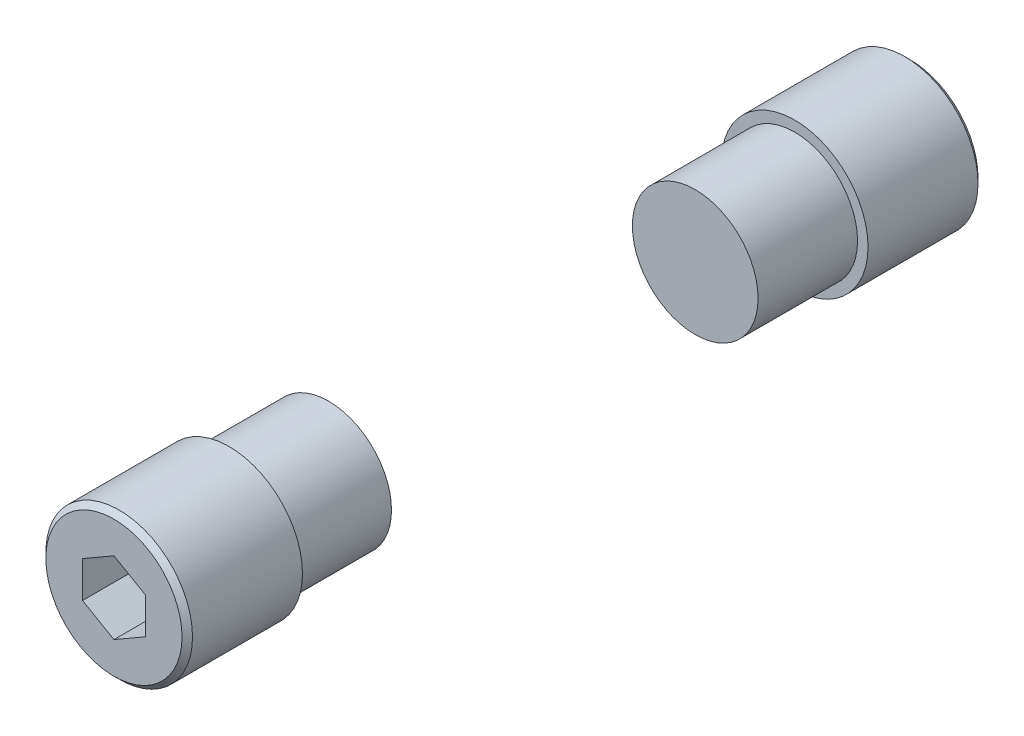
ISO-10303-21;
HEADER;
FILE_DESCRIPTION(('STEP AP214'),'2;1');
FILE_NAME('part.step','',(''),(''),'','','');
FILE_SCHEMA(('AUTOMOTIVE_DESIGN { 1 0 10303 214 1 1 1 1 }'));
ENDSEC;
DATA;
#1=APPLICATION_CONTEXT('core data for automotive mechanical design processes');
#2=APPLICATION_PROTOCOL_DEFINITION('international standard','automotive_design',2000,#1);
#3=PRODUCT_CONTEXT('',#1,'mechanical');
#4=PRODUCT('Part','Part','',(#3));
#5=PRODUCT_RELATED_PRODUCT_CATEGORY('part','',(#4));
#6=PRODUCT_DEFINITION_FORMATION('','',#4);
#7=PRODUCT_DEFINITION_CONTEXT('part definition',#1,'design');
#8=PRODUCT_DEFINITION('design','',#6,#7);
#9=PRODUCT_DEFINITION_SHAPE('','',#8);
#10=(LENGTH_UNIT() NAMED_UNIT(*) SI_UNIT(.MILLI.,.METRE.));
#11=(NAMED_UNIT(*) PLANE_ANGLE_UNIT() SI_UNIT($,.RADIAN.));
#12=(NAMED_UNIT(*) SI_UNIT($,.STERADIAN.) SOLID_ANGLE_UNIT());
#13=UNCERTAINTY_MEASURE_WITH_UNIT(LENGTH_MEASURE(1.E-05),#10,'distance_accuracy_value','');
#14=(GEOMETRIC_REPRESENTATION_CONTEXT(3) GLOBAL_UNCERTAINTY_ASSIGNED_CONTEXT((#13)) GLOBAL_UNIT_ASSIGNED_CONTEXT((#10,
#11,#12)) REPRESENTATION_CONTEXT('',''));
#15=CARTESIAN_POINT('',(0.,0.,0.));
#16=DIRECTION('',(0.,0.,1.));
#17=DIRECTION('',(1.,0.,0.));
#18=AXIS2_PLACEMENT_3D('',#15,#16,#17);
#19=CARTESIAN_POINT('',(0.,0.,27.));
#20=DIRECTION('',(0.,0.,1.));
#21=DIRECTION('',(1.,0.,0.));
#22=AXIS2_PLACEMENT_3D('',#19,#20,#21);
#23=PLANE('',#22);
#24=CARTESIAN_POINT('',(0.,0.,27.));
#25=DIRECTION('',(0.,0.,1.));
#26=DIRECTION('',(1.,0.,0.));
#27=AXIS2_PLACEMENT_3D('',#24,#25,#26);
#28=CIRCLE('',#27,7.);
#29=CARTESIAN_POINT('',(7.,0.,27.));
#30=VERTEX_POINT('',#29);
#31=EDGE_CURVE('P0_E120',#30,#30,#28,.T.);
#32=ORIENTED_EDGE('',*,*,#31,.F.);
#33=EDGE_LOOP('',(#32));
#34=FACE_BOUND('',#33,.T.);
#35=CARTESIAN_POINT('',(0.,0.,27.));
#36=DIRECTION('',(0.,0.,1.));
#37=DIRECTION('',(1.,0.,0.));
#38=AXIS2_PLACEMENT_3D('',#35,#36,#37);
#39=CIRCLE('',#38,6.);
#40=CARTESIAN_POINT('',(6.,0.,27.));
#41=VERTEX_POINT('',#40);
#42=EDGE_CURVE('P0_E11',#41,#41,#39,.F.);
#43=ORIENTED_EDGE('',*,*,#42,.F.);
#44=EDGE_LOOP('',(#43));
#45=FACE_BOUND('',#44,.T.);
#46=ADVANCED_FACE('P0_F17',(#34,#45),#23,.F.);
#47=CARTESIAN_POINT('',(0.,0.,27.));
#48=DIRECTION('',(0.,0.,1.));
#49=DIRECTION('',(1.,0.,0.));
#50=AXIS2_PLACEMENT_3D('',#47,#48,#49);
#51=CYLINDRICAL_SURFACE('',#50,7.);
#52=CARTESIAN_POINT('',(0.,0.,37.5));
#53=DIRECTION('',(0.,0.,1.));
#54=DIRECTION('',(1.,0.,0.));
#55=AXIS2_PLACEMENT_3D('',#52,#53,#54);
#56=CIRCLE('',#55,7.);
#57=CARTESIAN_POINT('',(7.,0.,37.5));
#58=VERTEX_POINT('',#57);
#59=EDGE_CURVE('P0_E25',#58,#58,#56,.F.);
#60=ORIENTED_EDGE('',*,*,#59,.T.);
#61=EDGE_LOOP('',(#60));
#62=FACE_BOUND('',#61,.T.);
#63=ORIENTED_EDGE('',*,*,#31,.T.);
#64=EDGE_LOOP('',(#63));
#65=FACE_BOUND('',#64,.T.);
#66=ADVANCED_FACE('P0_F133',(#62,#65),#51,.T.);
#67=CARTESIAN_POINT('',(0.,0.,38.));
#68=DIRECTION('',(0.,0.,1.));
#69=DIRECTION('',(1.,0.,0.));
#70=AXIS2_PLACEMENT_3D('',#67,#68,#69);
#71=PLANE('',#70);
#72=DIRECTION('',(-0.866025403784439,0.5,0.));
#73=VECTOR('',#72,1.);
#74=CARTESIAN_POINT('',(3.,1.73205080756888,38.));
#75=LINE('',#74,#73);
#76=CARTESIAN_POINT('',(3.,1.73205080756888,38.));
#77=VERTEX_POINT('',#76);
#78=CARTESIAN_POINT('',(0.,3.46410161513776,38.));
#79=VERTEX_POINT('',#78);
#80=EDGE_CURVE('P0_E32',#77,#79,#75,.T.);
#81=ORIENTED_EDGE('',*,*,#80,.F.);
#82=DIRECTION('',(0.,1.,0.));
#83=VECTOR('',#82,1.);
#84=CARTESIAN_POINT('',(3.,-1.73205080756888,38.));
#85=LINE('',#84,#83);
#86=CARTESIAN_POINT('',(3.,-1.73205080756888,38.));
#87=VERTEX_POINT('',#86);
#88=EDGE_CURVE('P0_E116',#87,#77,#85,.T.);
#89=ORIENTED_EDGE('',*,*,#88,.F.);
#90=DIRECTION('',(0.866025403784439,0.5,0.));
#91=VECTOR('',#90,1.);
#92=CARTESIAN_POINT('',(0.,-3.46410161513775,38.));
#93=LINE('',#92,#91);
#94=CARTESIAN_POINT('',(0.,-3.46410161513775,38.));
#95=VERTEX_POINT('',#94);
#96=EDGE_CURVE('P0_E114',#95,#87,#93,.T.);
#97=ORIENTED_EDGE('',*,*,#96,.F.);
#98=DIRECTION('',(0.866025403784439,-0.5,0.));
#99=VECTOR('',#98,1.);
#100=CARTESIAN_POINT('',(-3.,-1.73205080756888,38.));
#101=LINE('',#100,#99);
#102=CARTESIAN_POINT('',(-3.,-1.73205080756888,38.));
#103=VERTEX_POINT('',#102);
#104=EDGE_CURVE('P0_E80',#103,#95,#101,.T.);
#105=ORIENTED_EDGE('',*,*,#104,.F.);
#106=DIRECTION('',(0.,-1.,0.));
#107=VECTOR('',#106,1.);
#108=CARTESIAN_POINT('',(-3.,1.73205080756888,38.));
#109=LINE('',#108,#107);
#110=CARTESIAN_POINT('',(-3.,1.73205080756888,38.));
#111=VERTEX_POINT('',#110);
#112=EDGE_CURVE('P0_E110',#111,#103,#109,.T.);
#113=ORIENTED_EDGE('',*,*,#112,.F.);
#114=DIRECTION('',(-0.866025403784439,-0.5,0.));
#115=VECTOR('',#114,1.);
#116=CARTESIAN_POINT('',(0.,3.46410161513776,38.));
#117=LINE('',#116,#115);
#118=EDGE_CURVE('P0_E106',#79,#111,#117,.T.);
#119=ORIENTED_EDGE('',*,*,#118,.F.);
#120=EDGE_LOOP('',(#81,#89,#97,#105,#113,#119));
#121=FACE_BOUND('',#120,.T.);
#122=CARTESIAN_POINT('',(0.,0.,38.));
#123=DIRECTION('',(0.,0.,1.));
#124=DIRECTION('',(1.,0.,0.));
#125=AXIS2_PLACEMENT_3D('',#122,#123,#124);
#126=CIRCLE('',#125,6.5);
#127=CARTESIAN_POINT('',(6.5,0.,38.));
#128=VERTEX_POINT('',#127);
#129=EDGE_CURVE('P0_E128',#128,#128,#126,.T.);
#130=ORIENTED_EDGE('',*,*,#129,.T.);
#131=EDGE_LOOP('',(#130));
#132=FACE_BOUND('',#131,.T.);
#133=ADVANCED_FACE('P0_F139',(#121,#132),#71,.T.);
#134=CARTESIAN_POINT('',(0.,0.,38.));
#135=DIRECTION('',(0.,0.,-1.));
#136=DIRECTION('',(-1.,0.,0.));
#137=AXIS2_PLACEMENT_3D('',#134,#135,#136);
#138=CONICAL_SURFACE('',#137,6.5,0.785398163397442);
#139=ORIENTED_EDGE('',*,*,#59,.F.);
#140=EDGE_LOOP('',(#139));
#141=FACE_BOUND('',#140,.T.);
#142=ORIENTED_EDGE('',*,*,#129,.F.);
#143=EDGE_LOOP('',(#142));
#144=FACE_BOUND('',#143,.T.);
#145=ADVANCED_FACE('P0_F19',(#141,#144),#138,.T.);
#146=CARTESIAN_POINT('',(3.,1.73205080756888,33.));
#147=DIRECTION('',(0.5,0.866025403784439,0.));
#148=DIRECTION('',(-0.866025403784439,0.5,0.));
#149=AXIS2_PLACEMENT_3D('',#146,#147,#148);
#150=PLANE('',#149);
#151=ORIENTED_EDGE('',*,*,#80,.T.);
#152=DIRECTION('',(0.,0.,1.));
#153=VECTOR('',#152,1.);
#154=CARTESIAN_POINT('',(0.,3.46410161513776,33.));
#155=LINE('',#154,#153);
#156=CARTESIAN_POINT('',(0.,3.46410161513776,33.));
#157=VERTEX_POINT('',#156);
#158=EDGE_CURVE('P0_E62',#157,#79,#155,.T.);
#159=ORIENTED_EDGE('',*,*,#158,.F.);
#160=DIRECTION('',(-0.866025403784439,0.5,0.));
#161=VECTOR('',#160,1.);
#162=CARTESIAN_POINT('',(3.,1.73205080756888,33.));
#163=LINE('',#162,#161);
#164=CARTESIAN_POINT('',(3.,1.73205080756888,33.));
#165=VERTEX_POINT('',#164);
#166=EDGE_CURVE('P0_E118',#165,#157,#163,.T.);
#167=ORIENTED_EDGE('',*,*,#166,.F.);
#168=DIRECTION('',(0.,0.,1.));
#169=VECTOR('',#168,1.);
#170=CARTESIAN_POINT('',(3.,1.73205080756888,33.));
#171=LINE('',#170,#169);
#172=EDGE_CURVE('P0_E40',#165,#77,#171,.T.);
#173=ORIENTED_EDGE('',*,*,#172,.T.);
#174=EDGE_LOOP('',(#151,#159,#167,#173));
#175=FACE_BOUND('',#174,.T.);
#176=ADVANCED_FACE('P0_F138',(#175),#150,.F.);
#177=CARTESIAN_POINT('',(3.,-1.73205080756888,33.));
#178=DIRECTION('',(1.,0.,0.));
#179=DIRECTION('',(0.,0.,-1.));
#180=AXIS2_PLACEMENT_3D('',#177,#178,#179);
#181=PLANE('',#180);
#182=ORIENTED_EDGE('',*,*,#88,.T.);
#183=ORIENTED_EDGE('',*,*,#172,.F.);
#184=DIRECTION('',(0.,1.,0.));
#185=VECTOR('',#184,1.);
#186=CARTESIAN_POINT('',(3.,-1.73205080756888,33.));
#187=LINE('',#186,#185);
#188=CARTESIAN_POINT('',(3.,-1.73205080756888,33.));
#189=VERTEX_POINT('',#188);
#190=EDGE_CURVE('P0_E92',#189,#165,#187,.T.);
#191=ORIENTED_EDGE('',*,*,#190,.F.);
#192=DIRECTION('',(0.,0.,1.));
#193=VECTOR('',#192,1.);
#194=CARTESIAN_POINT('',(3.,-1.73205080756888,33.));
#195=LINE('',#194,#193);
#196=EDGE_CURVE('P0_E84',#189,#87,#195,.T.);
#197=ORIENTED_EDGE('',*,*,#196,.T.);
#198=EDGE_LOOP('',(#182,#183,#191,#197));
#199=FACE_BOUND('',#198,.T.);
#200=ADVANCED_FACE('P0_F161',(#199),#181,.F.);
#201=CARTESIAN_POINT('',(0.,-3.46410161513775,33.));
#202=DIRECTION('',(0.5,-0.866025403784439,0.));
#203=DIRECTION('',(0.866025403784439,0.5,0.));
#204=AXIS2_PLACEMENT_3D('',#201,#202,#203);
#205=PLANE('',#204);
#206=ORIENTED_EDGE('',*,*,#96,.T.);
#207=ORIENTED_EDGE('',*,*,#196,.F.);
#208=DIRECTION('',(0.866025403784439,0.5,0.));
#209=VECTOR('',#208,1.);
#210=CARTESIAN_POINT('',(0.,-3.46410161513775,33.));
#211=LINE('',#210,#209);
#212=CARTESIAN_POINT('',(0.,-3.46410161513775,33.));
#213=VERTEX_POINT('',#212);
#214=EDGE_CURVE('P0_E88',#213,#189,#211,.T.);
#215=ORIENTED_EDGE('',*,*,#214,.F.);
#216=DIRECTION('',(0.,0.,1.));
#217=VECTOR('',#216,1.);
#218=CARTESIAN_POINT('',(0.,-3.46410161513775,33.));
#219=LINE('',#218,#217);
#220=EDGE_CURVE('P0_E73',#213,#95,#219,.T.);
#221=ORIENTED_EDGE('',*,*,#220,.T.);
#222=EDGE_LOOP('',(#206,#207,#215,#221));
#223=FACE_BOUND('',#222,.T.);
#224=ADVANCED_FACE('P0_F89',(#223),#205,.F.);
#225=CARTESIAN_POINT('',(-3.,-1.73205080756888,33.));
#226=DIRECTION('',(-0.5,-0.866025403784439,0.));
#227=DIRECTION('',(0.866025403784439,-0.5,0.));
#228=AXIS2_PLACEMENT_3D('',#225,#226,#227);
#229=PLANE('',#228);
#230=ORIENTED_EDGE('',*,*,#104,.T.);
#231=ORIENTED_EDGE('',*,*,#220,.F.);
#232=DIRECTION('',(0.866025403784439,-0.5,0.));
#233=VECTOR('',#232,1.);
#234=CARTESIAN_POINT('',(-3.,-1.73205080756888,33.));
#235=LINE('',#234,#233);
#236=CARTESIAN_POINT('',(-3.,-1.73205080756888,33.));
#237=VERTEX_POINT('',#236);
#238=EDGE_CURVE('P0_E77',#237,#213,#235,.T.);
#239=ORIENTED_EDGE('',*,*,#238,.F.);
#240=DIRECTION('',(0.,0.,1.));
#241=VECTOR('',#240,1.);
#242=CARTESIAN_POINT('',(-3.,-1.73205080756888,33.));
#243=LINE('',#242,#241);
#244=EDGE_CURVE('P0_E85',#237,#103,#243,.T.);
#245=ORIENTED_EDGE('',*,*,#244,.T.);
#246=EDGE_LOOP('',(#230,#231,#239,#245));
#247=FACE_BOUND('',#246,.T.);
#248=ADVANCED_FACE('P0_F75',(#247),#229,.F.);
#249=CARTESIAN_POINT('',(-3.,1.73205080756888,33.));
#250=DIRECTION('',(-1.,0.,0.));
#251=DIRECTION('',(0.,-1.,0.));
#252=AXIS2_PLACEMENT_3D('',#249,#250,#251);
#253=PLANE('',#252);
#254=ORIENTED_EDGE('',*,*,#112,.T.);
#255=ORIENTED_EDGE('',*,*,#244,.F.);
#256=DIRECTION('',(0.,-1.,0.));
#257=VECTOR('',#256,1.);
#258=CARTESIAN_POINT('',(-3.,1.73205080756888,33.));
#259=LINE('',#258,#257);
#260=CARTESIAN_POINT('',(-3.,1.73205080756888,33.));
#261=VERTEX_POINT('',#260);
#262=EDGE_CURVE('P0_E98',#261,#237,#259,.T.);
#263=ORIENTED_EDGE('',*,*,#262,.F.);
#264=DIRECTION('',(0.,0.,1.));
#265=VECTOR('',#264,1.);
#266=CARTESIAN_POINT('',(-3.,1.73205080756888,33.));
#267=LINE('',#266,#265);
#268=EDGE_CURVE('P0_E123',#261,#111,#267,.T.);
#269=ORIENTED_EDGE('',*,*,#268,.T.);
#270=EDGE_LOOP('',(#254,#255,#263,#269));
#271=FACE_BOUND('',#270,.T.);
#272=ADVANCED_FACE('P0_F165',(#271),#253,.F.);
#273=CARTESIAN_POINT('',(0.,3.46410161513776,33.));
#274=DIRECTION('',(-0.5,0.866025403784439,0.));
#275=DIRECTION('',(-0.866025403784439,-0.5,0.));
#276=AXIS2_PLACEMENT_3D('',#273,#274,#275);
#277=PLANE('',#276);
#278=ORIENTED_EDGE('',*,*,#118,.T.);
#279=ORIENTED_EDGE('',*,*,#268,.F.);
#280=DIRECTION('',(-0.866025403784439,-0.5,0.));
#281=VECTOR('',#280,1.);
#282=CARTESIAN_POINT('',(0.,3.46410161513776,33.));
#283=LINE('',#282,#281);
#284=EDGE_CURVE('P0_E100',#157,#261,#283,.T.);
#285=ORIENTED_EDGE('',*,*,#284,.F.);
#286=ORIENTED_EDGE('',*,*,#158,.T.);
#287=EDGE_LOOP('',(#278,#279,#285,#286));
#288=FACE_BOUND('',#287,.T.);
#289=ADVANCED_FACE('P0_F162',(#288),#277,.F.);
#290=CARTESIAN_POINT('',(0.,3.46410161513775,33.));
#291=DIRECTION('',(0.,0.,1.));
#292=DIRECTION('',(1.,0.,0.));
#293=AXIS2_PLACEMENT_3D('',#290,#291,#292);
#294=PLANE('',#293);
#295=ORIENTED_EDGE('',*,*,#166,.T.);
#296=ORIENTED_EDGE('',*,*,#284,.T.);
#297=ORIENTED_EDGE('',*,*,#262,.T.);
#298=ORIENTED_EDGE('',*,*,#238,.T.);
#299=ORIENTED_EDGE('',*,*,#214,.T.);
#300=ORIENTED_EDGE('',*,*,#190,.T.);
#301=EDGE_LOOP('',(#295,#296,#297,#298,#299,#300));
#302=FACE_BOUND('',#301,.T.);
#303=ADVANCED_FACE('P0_F95',(#302),#294,.T.);
#304=CARTESIAN_POINT('',(0.,0.,17.5));
#305=DIRECTION('',(0.,0.,1.));
#306=DIRECTION('',(1.,0.,0.));
#307=AXIS2_PLACEMENT_3D('',#304,#305,#306);
#308=CYLINDRICAL_SURFACE('',#307,6.);
#309=CARTESIAN_POINT('',(0.,0.,17.5));
#310=DIRECTION('',(0.,0.,-1.));
#311=DIRECTION('',(-1.,0.,0.));
#312=AXIS2_PLACEMENT_3D('',#309,#310,#311);
#313=CIRCLE('',#312,6.);
#314=CARTESIAN_POINT('',(-6.,0.,17.5));
#315=VERTEX_POINT('',#314);
#316=EDGE_CURVE('P0_E107',#315,#315,#313,.T.);
#317=ORIENTED_EDGE('',*,*,#316,.F.);
#318=EDGE_LOOP('',(#317));
#319=FACE_BOUND('',#318,.T.);
#320=ORIENTED_EDGE('',*,*,#42,.T.);
#321=EDGE_LOOP('',(#320));
#322=FACE_BOUND('',#321,.T.);
#323=ADVANCED_FACE('P0_F178',(#319,#322),#308,.T.);
#324=CARTESIAN_POINT('',(0.,0.,17.5));
#325=DIRECTION('',(0.,0.,-1.));
#326=DIRECTION('',(-1.,0.,0.));
#327=AXIS2_PLACEMENT_3D('',#324,#325,#326);
#328=PLANE('',#327);
#329=ORIENTED_EDGE('',*,*,#316,.T.);
#330=EDGE_LOOP('',(#329));
#331=FACE_BOUND('',#330,.T.);
#332=ADVANCED_FACE('P0_F181',(#331),#328,.T.);
#333=CLOSED_SHELL('',(#46,#66,#133,#145,#176,#200,#224,#248,#272,#289,#303,#323,#332));
#334=MANIFOLD_SOLID_BREP('P0_B1',#333);
#335=CARTESIAN_POINT('',(0.,0.,-27.));
#336=DIRECTION('',(0.,0.,-1.));
#337=DIRECTION('',(1.,0.,0.));
#338=AXIS2_PLACEMENT_3D('',#335,#336,#337);
#339=PLANE('',#338);
#340=CARTESIAN_POINT('',(0.,0.,-27.));
#341=DIRECTION('',(0.,0.,1.));
#342=DIRECTION('',(1.,0.,0.));
#343=AXIS2_PLACEMENT_3D('',#340,#341,#342);
#344=CIRCLE('',#343,7.);
#345=CARTESIAN_POINT('',(7.,0.,-27.));
#346=VERTEX_POINT('',#345);
#347=EDGE_CURVE('P1_E106',#346,#346,#344,.T.);
#348=ORIENTED_EDGE('',*,*,#347,.T.);
#349=EDGE_LOOP('',(#348));
#350=FACE_BOUND('',#349,.T.);
#351=CARTESIAN_POINT('',(0.,0.,-27.));
#352=DIRECTION('',(0.,0.,1.));
#353=DIRECTION('',(1.,0.,0.));
#354=AXIS2_PLACEMENT_3D('',#351,#352,#353);
#355=CIRCLE('',#354,6.);
#356=CARTESIAN_POINT('',(6.,0.,-27.));
#357=VERTEX_POINT('',#356);
#358=EDGE_CURVE('P1_E10',#357,#357,#355,.F.);
#359=ORIENTED_EDGE('',*,*,#358,.T.);
#360=EDGE_LOOP('',(#359));
#361=FACE_BOUND('',#360,.T.);
#362=ADVANCED_FACE('P1_F16',(#350,#361),#339,.F.);
#363=CARTESIAN_POINT('',(0.,0.,-27.));
#364=DIRECTION('',(0.,0.,-1.));
#365=DIRECTION('',(1.,0.,0.));
#366=AXIS2_PLACEMENT_3D('',#363,#364,#365);
#367=CYLINDRICAL_SURFACE('',#366,7.);
#368=CARTESIAN_POINT('',(0.,0.,-37.5));
#369=DIRECTION('',(0.,0.,1.));
#370=DIRECTION('',(1.,0.,0.));
#371=AXIS2_PLACEMENT_3D('',#368,#369,#370);
#372=CIRCLE('',#371,7.);
#373=CARTESIAN_POINT('',(7.,0.,-37.5));
#374=VERTEX_POINT('',#373);
#375=EDGE_CURVE('P1_E24',#374,#374,#372,.F.);
#376=ORIENTED_EDGE('',*,*,#375,.F.);
#377=EDGE_LOOP('',(#376));
#378=FACE_BOUND('',#377,.T.);
#379=ORIENTED_EDGE('',*,*,#347,.F.);
#380=EDGE_LOOP('',(#379));
#381=FACE_BOUND('',#380,.T.);
#382=ADVANCED_FACE('P1_F116',(#378,#381),#367,.T.);
#383=CARTESIAN_POINT('',(0.,0.,-38.));
#384=DIRECTION('',(0.,0.,-1.));
#385=DIRECTION('',(1.,0.,0.));
#386=AXIS2_PLACEMENT_3D('',#383,#384,#385);
#387=PLANE('',#386);
#388=DIRECTION('',(-0.866025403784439,0.5,0.));
#389=VECTOR('',#388,1.);
#390=CARTESIAN_POINT('',(3.,1.73205080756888,-38.));
#391=LINE('',#390,#389);
#392=CARTESIAN_POINT('',(3.,1.73205080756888,-38.));
#393=VERTEX_POINT('',#392);
#394=CARTESIAN_POINT('',(0.,3.46410161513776,-38.));
#395=VERTEX_POINT('',#394);
#396=EDGE_CURVE('P1_E170',#393,#395,#391,.T.);
#397=ORIENTED_EDGE('',*,*,#396,.T.);
#398=DIRECTION('',(-0.866025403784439,-0.5,0.));
#399=VECTOR('',#398,1.);
#400=CARTESIAN_POINT('',(0.,3.46410161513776,-38.));
#401=LINE('',#400,#399);
#402=CARTESIAN_POINT('',(-3.,1.73205080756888,-38.));
#403=VERTEX_POINT('',#402);
#404=EDGE_CURVE('P1_E173',#395,#403,#401,.T.);
#405=ORIENTED_EDGE('',*,*,#404,.T.);
#406=DIRECTION('',(0.,-1.,0.));
#407=VECTOR('',#406,1.);
#408=CARTESIAN_POINT('',(-3.,1.73205080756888,-38.));
#409=LINE('',#408,#407);
#410=CARTESIAN_POINT('',(-3.,-1.73205080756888,-38.));
#411=VERTEX_POINT('',#410);
#412=EDGE_CURVE('P1_E177',#403,#411,#409,.T.);
#413=ORIENTED_EDGE('',*,*,#412,.T.);
#414=DIRECTION('',(0.866025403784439,-0.5,0.));
#415=VECTOR('',#414,1.);
#416=CARTESIAN_POINT('',(-3.,-1.73205080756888,-38.));
#417=LINE('',#416,#415);
#418=CARTESIAN_POINT('',(0.,-3.46410161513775,-38.));
#419=VERTEX_POINT('',#418);
#420=EDGE_CURVE('P1_E183',#411,#419,#417,.T.);
#421=ORIENTED_EDGE('',*,*,#420,.T.);
#422=DIRECTION('',(0.866025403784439,0.5,0.));
#423=VECTOR('',#422,1.);
#424=CARTESIAN_POINT('',(0.,-3.46410161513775,-38.));
#425=LINE('',#424,#423);
#426=CARTESIAN_POINT('',(3.,-1.73205080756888,-38.));
#427=VERTEX_POINT('',#426);
#428=EDGE_CURVE('P1_E95',#419,#427,#425,.T.);
#429=ORIENTED_EDGE('',*,*,#428,.T.);
#430=DIRECTION('',(0.,1.,0.));
#431=VECTOR('',#430,1.);
#432=CARTESIAN_POINT('',(3.,-1.73205080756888,-38.));
#433=LINE('',#432,#431);
#434=EDGE_CURVE('P1_E174',#427,#393,#433,.T.);
#435=ORIENTED_EDGE('',*,*,#434,.T.);
#436=EDGE_LOOP('',(#397,#405,#413,#421,#429,#435));
#437=FACE_BOUND('',#436,.T.);
#438=CARTESIAN_POINT('',(0.,0.,-38.));
#439=DIRECTION('',(0.,0.,1.));
#440=DIRECTION('',(1.,0.,0.));
#441=AXIS2_PLACEMENT_3D('',#438,#439,#440);
#442=CIRCLE('',#441,6.5);
#443=CARTESIAN_POINT('',(6.5,0.,-38.));
#444=VERTEX_POINT('',#443);
#445=EDGE_CURVE('P1_E109',#444,#444,#442,.T.);
#446=ORIENTED_EDGE('',*,*,#445,.F.);
#447=EDGE_LOOP('',(#446));
#448=FACE_BOUND('',#447,.T.);
#449=ADVANCED_FACE('P1_F119',(#437,#448),#387,.T.);
#450=CARTESIAN_POINT('',(0.,0.,-38.));
#451=DIRECTION('',(0.,0.,1.));
#452=DIRECTION('',(-1.,0.,0.));
#453=AXIS2_PLACEMENT_3D('',#450,#451,#452);
#454=CONICAL_SURFACE('',#453,6.5,0.785398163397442);
#455=ORIENTED_EDGE('',*,*,#375,.T.);
#456=EDGE_LOOP('',(#455));
#457=FACE_BOUND('',#456,.T.);
#458=ORIENTED_EDGE('',*,*,#445,.T.);
#459=EDGE_LOOP('',(#458));
#460=FACE_BOUND('',#459,.T.);
#461=ADVANCED_FACE('P1_F18',(#457,#460),#454,.T.);
#462=CARTESIAN_POINT('',(3.,1.73205080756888,-33.));
#463=DIRECTION('',(0.5,0.866025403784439,0.));
#464=DIRECTION('',(-0.866025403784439,0.5,0.));
#465=AXIS2_PLACEMENT_3D('',#462,#463,#464);
#466=PLANE('',#465);
#467=ORIENTED_EDGE('',*,*,#396,.F.);
#468=DIRECTION('',(0.,0.,-1.));
#469=VECTOR('',#468,1.);
#470=CARTESIAN_POINT('',(3.,1.73205080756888,-33.));
#471=LINE('',#470,#469);
#472=CARTESIAN_POINT('',(3.,1.73205080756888,-33.));
#473=VERTEX_POINT('',#472);
#474=EDGE_CURVE('P1_E62',#473,#393,#471,.T.);
#475=ORIENTED_EDGE('',*,*,#474,.F.);
#476=DIRECTION('',(-0.866025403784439,0.5,0.));
#477=VECTOR('',#476,1.);
#478=CARTESIAN_POINT('',(3.,1.73205080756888,-33.));
#479=LINE('',#478,#477);
#480=CARTESIAN_POINT('',(0.,3.46410161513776,-33.));
#481=VERTEX_POINT('',#480);
#482=EDGE_CURVE('P1_E186',#473,#481,#479,.T.);
#483=ORIENTED_EDGE('',*,*,#482,.T.);
#484=DIRECTION('',(0.,0.,-1.));
#485=VECTOR('',#484,1.);
#486=CARTESIAN_POINT('',(0.,3.46410161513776,-33.));
#487=LINE('',#486,#485);
#488=EDGE_CURVE('P1_E31',#481,#395,#487,.T.);
#489=ORIENTED_EDGE('',*,*,#488,.T.);
#490=EDGE_LOOP('',(#467,#475,#483,#489));
#491=FACE_BOUND('',#490,.T.);
#492=ADVANCED_FACE('P1_F147',(#491),#466,.F.);
#493=CARTESIAN_POINT('',(3.,-1.73205080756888,-33.));
#494=DIRECTION('',(1.,0.,0.));
#495=DIRECTION('',(0.,0.,1.));
#496=AXIS2_PLACEMENT_3D('',#493,#494,#495);
#497=PLANE('',#496);
#498=ORIENTED_EDGE('',*,*,#434,.F.);
#499=DIRECTION('',(0.,0.,-1.));
#500=VECTOR('',#499,1.);
#501=CARTESIAN_POINT('',(3.,-1.73205080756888,-33.));
#502=LINE('',#501,#500);
#503=CARTESIAN_POINT('',(3.,-1.73205080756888,-33.));
#504=VERTEX_POINT('',#503);
#505=EDGE_CURVE('P1_E97',#504,#427,#502,.T.);
#506=ORIENTED_EDGE('',*,*,#505,.F.);
#507=DIRECTION('',(0.,1.,0.));
#508=VECTOR('',#507,1.);
#509=CARTESIAN_POINT('',(3.,-1.73205080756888,-33.));
#510=LINE('',#509,#508);
#511=EDGE_CURVE('P1_E40',#504,#473,#510,.T.);
#512=ORIENTED_EDGE('',*,*,#511,.T.);
#513=ORIENTED_EDGE('',*,*,#474,.T.);
#514=EDGE_LOOP('',(#498,#506,#512,#513));
#515=FACE_BOUND('',#514,.T.);
#516=ADVANCED_FACE('P1_F144',(#515),#497,.F.);
#517=CARTESIAN_POINT('',(0.,-3.46410161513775,-33.));
#518=DIRECTION('',(0.5,-0.866025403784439,0.));
#519=DIRECTION('',(0.866025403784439,0.5,0.));
#520=AXIS2_PLACEMENT_3D('',#517,#518,#519);
#521=PLANE('',#520);
#522=ORIENTED_EDGE('',*,*,#428,.F.);
#523=DIRECTION('',(0.,0.,-1.));
#524=VECTOR('',#523,1.);
#525=CARTESIAN_POINT('',(0.,-3.46410161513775,-33.));
#526=LINE('',#525,#524);
#527=CARTESIAN_POINT('',(0.,-3.46410161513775,-33.));
#528=VERTEX_POINT('',#527);
#529=EDGE_CURVE('P1_E84',#528,#419,#526,.T.);
#530=ORIENTED_EDGE('',*,*,#529,.F.);
#531=DIRECTION('',(0.866025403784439,0.5,0.));
#532=VECTOR('',#531,1.);
#533=CARTESIAN_POINT('',(0.,-3.46410161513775,-33.));
#534=LINE('',#533,#532);
#535=EDGE_CURVE('P1_E87',#528,#504,#534,.T.);
#536=ORIENTED_EDGE('',*,*,#535,.T.);
#537=ORIENTED_EDGE('',*,*,#505,.T.);
#538=EDGE_LOOP('',(#522,#530,#536,#537));
#539=FACE_BOUND('',#538,.T.);
#540=ADVANCED_FACE('P1_F93',(#539),#521,.F.);
#541=CARTESIAN_POINT('',(-3.,-1.73205080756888,-33.));
#542=DIRECTION('',(-0.5,-0.866025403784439,0.));
#543=DIRECTION('',(0.866025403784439,-0.5,0.));
#544=AXIS2_PLACEMENT_3D('',#541,#542,#543);
#545=PLANE('',#544);
#546=ORIENTED_EDGE('',*,*,#420,.F.);
#547=DIRECTION('',(0.,0.,-1.));
#548=VECTOR('',#547,1.);
#549=CARTESIAN_POINT('',(-3.,-1.73205080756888,-33.));
#550=LINE('',#549,#548);
#551=CARTESIAN_POINT('',(-3.,-1.73205080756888,-33.));
#552=VERTEX_POINT('',#551);
#553=EDGE_CURVE('P1_E86',#552,#411,#550,.T.);
#554=ORIENTED_EDGE('',*,*,#553,.F.);
#555=DIRECTION('',(0.866025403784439,-0.5,0.));
#556=VECTOR('',#555,1.);
#557=CARTESIAN_POINT('',(-3.,-1.73205080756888,-33.));
#558=LINE('',#557,#556);
#559=EDGE_CURVE('P1_E79',#552,#528,#558,.T.);
#560=ORIENTED_EDGE('',*,*,#559,.T.);
#561=ORIENTED_EDGE('',*,*,#529,.T.);
#562=EDGE_LOOP('',(#546,#554,#560,#561));
#563=FACE_BOUND('',#562,.T.);
#564=ADVANCED_FACE('P1_F82',(#563),#545,.F.);
#565=CARTESIAN_POINT('',(-3.,1.73205080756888,-33.));
#566=DIRECTION('',(-1.,0.,0.));
#567=DIRECTION('',(0.,-1.,0.));
#568=AXIS2_PLACEMENT_3D('',#565,#566,#567);
#569=PLANE('',#568);
#570=ORIENTED_EDGE('',*,*,#412,.F.);
#571=DIRECTION('',(0.,0.,-1.));
#572=VECTOR('',#571,1.);
#573=CARTESIAN_POINT('',(-3.,1.73205080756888,-33.));
#574=LINE('',#573,#572);
#575=CARTESIAN_POINT('',(-3.,1.73205080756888,-33.));
#576=VERTEX_POINT('',#575);
#577=EDGE_CURVE('P1_E100',#576,#403,#574,.T.);
#578=ORIENTED_EDGE('',*,*,#577,.F.);
#579=DIRECTION('',(0.,-1.,0.));
#580=VECTOR('',#579,1.);
#581=CARTESIAN_POINT('',(-3.,1.73205080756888,-33.));
#582=LINE('',#581,#580);
#583=EDGE_CURVE('P1_E88',#576,#552,#582,.T.);
#584=ORIENTED_EDGE('',*,*,#583,.T.);
#585=ORIENTED_EDGE('',*,*,#553,.T.);
#586=EDGE_LOOP('',(#570,#578,#584,#585));
#587=FACE_BOUND('',#586,.T.);
#588=ADVANCED_FACE('P1_F152',(#587),#569,.F.);
#589=CARTESIAN_POINT('',(0.,3.46410161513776,-33.));
#590=DIRECTION('',(-0.5,0.866025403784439,0.));
#591=DIRECTION('',(-0.866025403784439,-0.5,0.));
#592=AXIS2_PLACEMENT_3D('',#589,#590,#591);
#593=PLANE('',#592);
#594=ORIENTED_EDGE('',*,*,#404,.F.);
#595=ORIENTED_EDGE('',*,*,#488,.F.);
#596=DIRECTION('',(-0.866025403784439,-0.5,0.));
#597=VECTOR('',#596,1.);
#598=CARTESIAN_POINT('',(0.,3.46410161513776,-33.));
#599=LINE('',#598,#597);
#600=EDGE_CURVE('P1_E70',#481,#576,#599,.T.);
#601=ORIENTED_EDGE('',*,*,#600,.T.);
#602=ORIENTED_EDGE('',*,*,#577,.T.);
#603=EDGE_LOOP('',(#594,#595,#601,#602));
#604=FACE_BOUND('',#603,.T.);
#605=ADVANCED_FACE('P1_F140',(#604),#593,.F.);
#606=CARTESIAN_POINT('',(0.,3.46410161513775,-33.));
#607=DIRECTION('',(0.,0.,-1.));
#608=DIRECTION('',(1.,0.,0.));
#609=AXIS2_PLACEMENT_3D('',#606,#607,#608);
#610=PLANE('',#609);
#611=ORIENTED_EDGE('',*,*,#482,.F.);
#612=ORIENTED_EDGE('',*,*,#511,.F.);
#613=ORIENTED_EDGE('',*,*,#535,.F.);
#614=ORIENTED_EDGE('',*,*,#559,.F.);
#615=ORIENTED_EDGE('',*,*,#583,.F.);
#616=ORIENTED_EDGE('',*,*,#600,.F.);
#617=EDGE_LOOP('',(#611,#612,#613,#614,#615,#616));
#618=FACE_BOUND('',#617,.T.);
#619=ADVANCED_FACE('P1_F90',(#618),#610,.T.);
#620=CARTESIAN_POINT('',(0.,0.,-17.5));
#621=DIRECTION('',(0.,0.,-1.));
#622=DIRECTION('',(1.,0.,0.));
#623=AXIS2_PLACEMENT_3D('',#620,#621,#622);
#624=CYLINDRICAL_SURFACE('',#623,6.);
#625=CARTESIAN_POINT('',(0.,0.,-17.5));
#626=DIRECTION('',(0.,0.,-1.));
#627=DIRECTION('',(-1.,0.,0.));
#628=AXIS2_PLACEMENT_3D('',#625,#626,#627);
#629=CIRCLE('',#628,6.);
#630=CARTESIAN_POINT('',(-6.,0.,-17.5));
#631=VERTEX_POINT('',#630);
#632=EDGE_CURVE('P1_E175',#631,#631,#629,.T.);
#633=ORIENTED_EDGE('',*,*,#632,.T.);
#634=EDGE_LOOP('',(#633));
#635=FACE_BOUND('',#634,.T.);
#636=ORIENTED_EDGE('',*,*,#358,.F.);
#637=EDGE_LOOP('',(#636));
#638=FACE_BOUND('',#637,.T.);
#639=ADVANCED_FACE('P1_F127',(#635,#638),#624,.T.);
#640=CARTESIAN_POINT('',(0.,0.,-17.5));
#641=DIRECTION('',(0.,0.,1.));
#642=DIRECTION('',(-1.,0.,0.));
#643=AXIS2_PLACEMENT_3D('',#640,#641,#642);
#644=PLANE('',#643);
#645=ORIENTED_EDGE('',*,*,#632,.F.);
#646=EDGE_LOOP('',(#645));
#647=FACE_BOUND('',#646,.T.);
#648=ADVANCED_FACE('P1_F129',(#647),#644,.T.);
#649=CLOSED_SHELL('',(#362,#382,#449,#461,#492,#516,#540,#564,#588,#605,#619,#639,#648));
#650=MANIFOLD_SOLID_BREP('P1_B1',#649);
#651=ADVANCED_BREP_SHAPE_REPRESENTATION('',(#18,#334,#650),#14);
#652=SHAPE_DEFINITION_REPRESENTATION(#9,#651);
ENDSEC;
END-ISO-10303-21;
